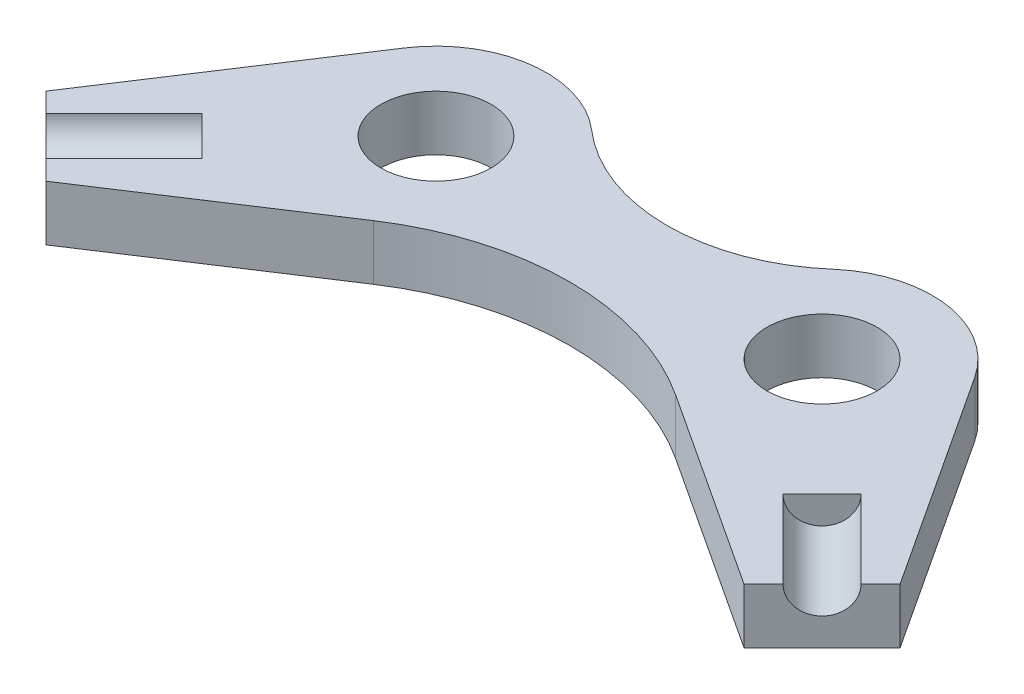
from build123d import *

# Parameters (mm, degrees)
CROQUIS1_R              = 4
SALIENTE_EXTRUIR1_DEPTH = 15
CROQUIS2_R              = 15
CORTAR_EXTRUIR1_DEPTH   = 22097.821385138
CROQUIS3_R              = 7.5
CORTAR_EXTRUIR2_DEPTH   = 30
CROQUIS4_R              = 7.5
CORTAR_EXTRUIR3_DEPTH   = 30


with BuildPart() as part:
    # Croquis1 → Saliente-Extruir1 (new body)
    with BuildSketch(Plane(origin=(0, 0, 0), x_dir=(1, 0, 0), z_dir=(0, 1, 0))):
        with BuildLine():
            Line((21419.298196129, 4422.623704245), (21398.084992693, 4443.836907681))
            Line((21398.084992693, 4443.836907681), (21436.62639469, 4502.697423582))
            ThreePointArc((21436.62639469, 4502.697423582), (21457.609295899, 4515.979711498), (21481.412103, 4508.899620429))
            ThreePointArc((21481.412103, 4508.899620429), (21514.224603, 4496.62679689), (21547.037103, 4508.899620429))
            ThreePointArc((21547.037103, 4508.899620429), (21570.839910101, 4515.979711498), (21591.822811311, 4502.697423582))
            Line((21591.822811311, 4502.697423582), (21630.364213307, 4443.836907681))
            Line((21630.364213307, 4443.836907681), (21609.151009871, 4422.623704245))
            Line((21609.151009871, 4422.623704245), (21555.309875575, 4457.878454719))
            ThreePointArc((21555.309875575, 4457.878454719), (21514.224603, 4470.132933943), (21473.139330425, 4457.878454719))
            Line((21473.139330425, 4457.878454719), (21419.298196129, 4422.623704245))
        make_face()
        with Locations(Location((21461.724603, 4486.263314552, 0), (0, 0, 270))):
            Circle(CROQUIS1_R, mode=Mode.SUBTRACT)
        with Locations(Location((21566.724603, 4486.263314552, 0), (0, 0, 270))):
            Circle(CROQUIS1_R, mode=Mode.SUBTRACT)
    extrude(amount=SALIENTE_EXTRUIR1_DEPTH)

    # Croquis2 → Cortar-Extruir1 (cut, through all)
    with BuildSketch(Plane(origin=(0, 15, 0), x_dir=(1, 0, 0), z_dir=(0, 1, 0))):
        with Locations(Location((21461.724603, 4486.263314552, 0), (0, 0, 270))):
            Circle(CROQUIS2_R)
        with Locations(Location((21566.724603, 4486.263314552, 0), (0, 0, 270))):
            Circle(CROQUIS2_R)
    extrude(amount=-CORTAR_EXTRUIR1_DEPTH, mode=Mode.SUBTRACT)

    # Croquis3 → Cortar-Extruir2 (cut)
    with BuildSketch(Plane(origin=(12920.960950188, 0, -12920.960950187), x_dir=(0.707106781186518, 0, 0.707106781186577), z_dir=(-0.707106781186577, 0, 0.707106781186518))):
        with Locations((12003.463790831, 15)):
            Circle(CROQUIS3_R)
    extrude(amount=-CORTAR_EXTRUIR2_DEPTH, mode=Mode.SUBTRACT)

    # Croquis4 → Cortar-Extruir3 (cut)
    with BuildSketch(Plane(origin=(8593.263652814, 0, 8593.263652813), x_dir=(0.707106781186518, 0, -0.707106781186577), z_dir=(0.707106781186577, 0, 0.707106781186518))):
        with Locations((18422.244426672, 15)):
            Circle(CROQUIS4_R)
    extrude(amount=-CORTAR_EXTRUIR3_DEPTH, mode=Mode.SUBTRACT)


solid = part.part
